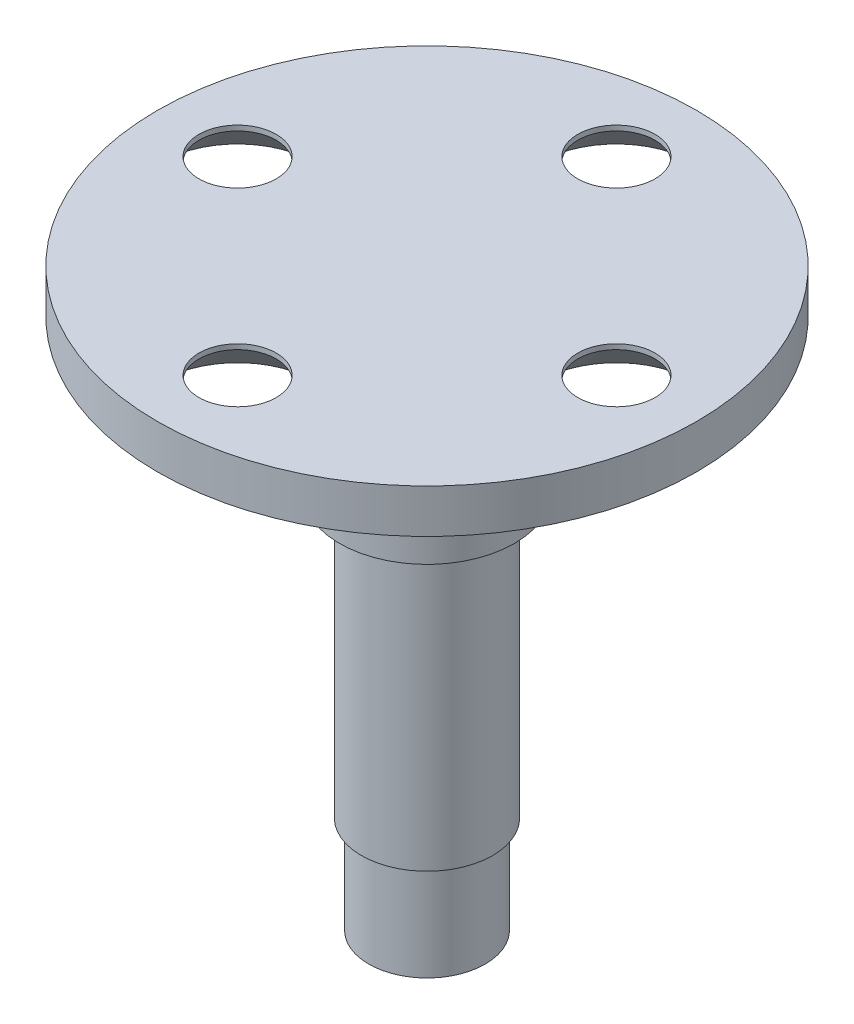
ISO-10303-21;
HEADER;
FILE_DESCRIPTION(('STEP AP214'),'2;1');
FILE_NAME('part.step','',(''),(''),'','','');
FILE_SCHEMA(('AUTOMOTIVE_DESIGN { 1 0 10303 214 1 1 1 1 }'));
ENDSEC;
DATA;
#1=APPLICATION_CONTEXT('core data for automotive mechanical design processes');
#2=APPLICATION_PROTOCOL_DEFINITION('international standard','automotive_design',2000,#1);
#3=PRODUCT_CONTEXT('',#1,'mechanical');
#4=PRODUCT('Part','Part','',(#3));
#5=PRODUCT_RELATED_PRODUCT_CATEGORY('part','',(#4));
#6=PRODUCT_DEFINITION_FORMATION('','',#4);
#7=PRODUCT_DEFINITION_CONTEXT('part definition',#1,'design');
#8=PRODUCT_DEFINITION('design','',#6,#7);
#9=PRODUCT_DEFINITION_SHAPE('','',#8);
#10=(LENGTH_UNIT() NAMED_UNIT(*) SI_UNIT(.MILLI.,.METRE.));
#11=(NAMED_UNIT(*) PLANE_ANGLE_UNIT() SI_UNIT($,.RADIAN.));
#12=(NAMED_UNIT(*) SI_UNIT($,.STERADIAN.) SOLID_ANGLE_UNIT());
#13=UNCERTAINTY_MEASURE_WITH_UNIT(LENGTH_MEASURE(1.E-05),#10,'distance_accuracy_value','');
#14=(GEOMETRIC_REPRESENTATION_CONTEXT(3) GLOBAL_UNCERTAINTY_ASSIGNED_CONTEXT((#13)) GLOBAL_UNIT_ASSIGNED_CONTEXT((#10,
#11,#12)) REPRESENTATION_CONTEXT('',''));
#15=CARTESIAN_POINT('',(0.,0.,0.));
#16=DIRECTION('',(0.,0.,1.));
#17=DIRECTION('',(1.,0.,0.));
#18=AXIS2_PLACEMENT_3D('',#15,#16,#17);
#19=CARTESIAN_POINT('',(0.,-36.,0.));
#20=DIRECTION('',(0.,-1.,0.));
#21=DIRECTION('',(1.,0.,0.));
#22=AXIS2_PLACEMENT_3D('',#19,#20,#21);
#23=CYLINDRICAL_SURFACE('',#22,4.5);
#24=CARTESIAN_POINT('',(0.,-10.,0.));
#25=DIRECTION('',(0.,-1.,0.));
#26=DIRECTION('',(1.,0.,0.));
#27=AXIS2_PLACEMENT_3D('',#24,#25,#26);
#28=CIRCLE('',#27,4.5);
#29=CARTESIAN_POINT('',(4.5,-10.,0.));
#30=VERTEX_POINT('',#29);
#31=EDGE_CURVE('E195',#30,#30,#28,.T.);
#32=ORIENTED_EDGE('',*,*,#31,.T.);
#33=EDGE_LOOP('',(#32));
#34=FACE_BOUND('',#33,.T.);
#35=CARTESIAN_POINT('',(0.,-29.3,0.));
#36=DIRECTION('',(0.,-1.,0.));
#37=DIRECTION('',(1.,0.,0.));
#38=AXIS2_PLACEMENT_3D('',#35,#36,#37);
#39=CIRCLE('',#38,4.5);
#40=CARTESIAN_POINT('',(4.5,-29.3,0.));
#41=VERTEX_POINT('',#40);
#42=EDGE_CURVE('E180',#41,#41,#39,.T.);
#43=ORIENTED_EDGE('',*,*,#42,.F.);
#44=EDGE_LOOP('',(#43));
#45=FACE_BOUND('',#44,.T.);
#46=DIRECTION('',(0.,-1.,0.));
#47=VECTOR('',#46,1.);
#48=CARTESIAN_POINT('',(-4.24264068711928,-36.,-1.5));
#49=LINE('',#48,#47);
#50=CARTESIAN_POINT('',(-4.24264068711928,-22.,-1.5));
#51=VERTEX_POINT('',#50);
#52=CARTESIAN_POINT('',(-4.24264068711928,-12.,-1.5));
#53=VERTEX_POINT('',#52);
#54=EDGE_CURVE('E13',#51,#53,#49,.F.);
#55=ORIENTED_EDGE('',*,*,#54,.T.);
#56=CARTESIAN_POINT('',(-4.24264068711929,-12.,1.5));
#57=CARTESIAN_POINT('',(-4.24264041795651,-12.0817022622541,1.50000038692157));
#58=CARTESIAN_POINT('',(-4.24502653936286,-12.1634021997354,1.49330217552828));
#59=CARTESIAN_POINT('',(-4.25426361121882,-12.3243816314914,1.46677669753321));
#60=CARTESIAN_POINT('',(-4.26111529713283,-12.4036607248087,1.44694726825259));
#61=CARTESIAN_POINT('',(-4.27842305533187,-12.5574403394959,1.39493322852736));
#62=CARTESIAN_POINT('',(-4.28887205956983,-12.6319498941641,1.36277283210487));
#63=CARTESIAN_POINT('',(-4.31218683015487,-12.7745400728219,1.28709244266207));
#64=CARTESIAN_POINT('',(-4.32505312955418,-12.8426192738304,1.24356994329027));
#65=CARTESIAN_POINT('',(-4.3523173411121,-12.9730799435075,1.14457671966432));
#66=CARTESIAN_POINT('',(-4.36675342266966,-13.0351731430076,1.08873651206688));
#67=CARTESIAN_POINT('',(-4.39520797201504,-13.149310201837,0.967481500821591));
#68=CARTESIAN_POINT('',(-4.40922637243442,-13.2013524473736,0.902065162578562));
#69=CARTESIAN_POINT('',(-4.43570800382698,-13.2952183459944,0.761406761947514));
#70=CARTESIAN_POINT('',(-4.44812111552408,-13.3367399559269,0.685952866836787));
#71=CARTESIAN_POINT('',(-4.46954380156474,-13.4063873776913,0.52864683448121));
#72=CARTESIAN_POINT('',(-4.47855429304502,-13.4345167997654,0.446796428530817));
#73=CARTESIAN_POINT('',(-4.49188613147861,-13.4756037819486,0.28204322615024));
#74=CARTESIAN_POINT('',(-4.49635972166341,-13.4890551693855,0.19927613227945));
#75=CARTESIAN_POINT('',(-4.5006541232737,-13.501974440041,0.0325468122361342));
#76=CARTESIAN_POINT('',(-4.50047613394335,-13.5014459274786,-0.0514151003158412));
#77=CARTESIAN_POINT('',(-4.49559059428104,-13.486733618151,-0.214655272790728));
#78=CARTESIAN_POINT('',(-4.49106097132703,-13.4730862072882,-0.293988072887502));
#79=CARTESIAN_POINT('',(-4.47820451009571,-13.4334105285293,-0.449165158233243));
#80=CARTESIAN_POINT('',(-4.46987741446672,-13.4073814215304,-0.525009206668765));
#81=CARTESIAN_POINT('',(-4.45013505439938,-13.3433680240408,-0.672228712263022));
#82=CARTESIAN_POINT('',(-4.43868063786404,-13.3052310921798,-0.743532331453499));
#83=CARTESIAN_POINT('',(-4.41387589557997,-13.2182104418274,-0.878886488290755));
#84=CARTESIAN_POINT('',(-4.40052504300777,-13.16932373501,-0.942935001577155));
#85=CARTESIAN_POINT('',(-4.37259287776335,-13.0594884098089,-1.06515129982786));
#86=CARTESIAN_POINT('',(-4.35798322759,-12.9980802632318,-1.12290023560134));
#87=CARTESIAN_POINT('',(-4.32971002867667,-12.866326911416,-1.22741588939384));
#88=CARTESIAN_POINT('',(-4.31604662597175,-12.7959803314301,-1.27418091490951));
#89=CARTESIAN_POINT('',(-4.29105787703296,-12.6470195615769,-1.3559811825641));
#90=CARTESIAN_POINT('',(-4.27976864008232,-12.5683018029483,-1.39083969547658));
#91=CARTESIAN_POINT('',(-4.26122476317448,-12.4056429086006,-1.44666478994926));
#92=CARTESIAN_POINT('',(-4.25396843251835,-12.3217039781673,-1.4676371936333));
#93=CARTESIAN_POINT('',(-4.24469454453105,-12.1550424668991,-1.49424192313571));
#94=CARTESIAN_POINT('',(-4.24245540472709,-12.0724358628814,-1.50052364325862));
#95=CARTESIAN_POINT('',(-4.242850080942,-11.9073357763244,-1.49940815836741));
#96=CARTESIAN_POINT('',(-4.24548301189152,-11.8248422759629,-1.49201343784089));
#97=CARTESIAN_POINT('',(-4.25510427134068,-11.6652645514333,-1.46433847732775));
#98=CARTESIAN_POINT('',(-4.2619398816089,-11.588091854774,-1.44450959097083));
#99=CARTESIAN_POINT('',(-4.27902830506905,-11.4381845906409,-1.3930707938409));
#100=CARTESIAN_POINT('',(-4.2892817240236,-11.3654508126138,-1.36145879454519));
#101=CARTESIAN_POINT('',(-4.31245316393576,-11.2239293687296,-1.28621151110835));
#102=CARTESIAN_POINT('',(-4.32544538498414,-11.1553400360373,-1.24222667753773));
#103=CARTESIAN_POINT('',(-4.35248653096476,-11.0262809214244,-1.14387844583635));
#104=CARTESIAN_POINT('',(-4.36653576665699,-10.9658135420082,-1.08951198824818));
#105=CARTESIAN_POINT('',(-4.39492557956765,-10.8517080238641,-0.968837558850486));
#106=CARTESIAN_POINT('',(-4.40924765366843,-10.7985384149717,-0.902080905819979));
#107=CARTESIAN_POINT('',(-4.43590277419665,-10.7041257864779,-0.760240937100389));
#108=CARTESIAN_POINT('',(-4.44823589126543,-10.6628823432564,-0.685157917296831));
#109=CARTESIAN_POINT('',(-4.46946608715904,-10.5938698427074,-0.529169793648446));
#110=CARTESIAN_POINT('',(-4.47838545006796,-10.5660130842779,-0.448306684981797));
#111=CARTESIAN_POINT('',(-4.49187916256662,-10.5244083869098,-0.282687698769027));
#112=CARTESIAN_POINT('',(-4.49645508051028,-10.5106553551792,-0.197933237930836));
#113=CARTESIAN_POINT('',(-4.50062794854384,-10.4981068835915,-0.0312230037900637));
#114=CARTESIAN_POINT('',(-4.50044880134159,-10.4986388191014,0.0506770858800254));
#115=CARTESIAN_POINT('',(-4.49568294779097,-10.5129859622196,0.213166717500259));
#116=CARTESIAN_POINT('',(-4.49109659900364,-10.5268000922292,0.293756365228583));
#117=CARTESIAN_POINT('',(-4.47811372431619,-10.5668733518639,0.450063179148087));
#118=CARTESIAN_POINT('',(-4.46977887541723,-10.5929313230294,0.525837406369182));
#119=CARTESIAN_POINT('',(-4.45015741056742,-10.6565662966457,0.671967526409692));
#120=CARTESIAN_POINT('',(-4.43887026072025,-10.6941453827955,0.742322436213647));
#121=CARTESIAN_POINT('',(-4.41398803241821,-10.781354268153,0.878451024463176));
#122=CARTESIAN_POINT('',(-4.4003230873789,-10.8313780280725,0.94395937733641));
#123=CARTESIAN_POINT('',(-4.37239483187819,-10.9413860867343,1.06587153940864));
#124=CARTESIAN_POINT('',(-4.35813133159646,-11.0013735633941,1.12227243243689));
#125=CARTESIAN_POINT('',(-4.32994919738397,-11.1324140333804,1.22661271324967));
#126=CARTESIAN_POINT('',(-4.31606591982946,-11.203808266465,1.27413444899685));
#127=CARTESIAN_POINT('',(-4.29090289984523,-11.3540016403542,1.35647151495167));
#128=CARTESIAN_POINT('',(-4.27962247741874,-11.4327988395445,1.39129016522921));
#129=CARTESIAN_POINT('',(-4.26152001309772,-11.5919427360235,1.44576574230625));
#130=CARTESIAN_POINT('',(-4.25451949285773,-11.6720583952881,1.46603686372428));
#131=CARTESIAN_POINT('',(-4.24508075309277,-11.8347840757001,1.4931514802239));
#132=CARTESIAN_POINT('',(-4.24264095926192,-11.9173932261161,1.49999960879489));
#133=CARTESIAN_POINT('',(-4.24264068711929,-12.,1.5));
#134=B_SPLINE_CURVE_WITH_KNOTS('',3,(#56,#57,#58,#59,#60,#61,#62,#63,#64,#65,#66,#67,#68,#69,
#70,#71,#72,#73,#74,#75,#76,#77,#78,#79,#80,#81,#82,#83,#84,#85,#86,#87,#88,#89,#90,#91,#92,#93,
#94,#95,#96,#97,#98,#99,#100,#101,#102,#103,#104,#105,#106,#107,#108,#109,#110,#111,#112,#113,
#114,#115,#116,#117,#118,#119,#120,#121,#122,#123,#124,#125,#126,#127,#128,#129,#130,#131,#132,
#133),.UNSPECIFIED.,.T.,.F.,(4,2,2,2,2,2,2,2,2,2,2,2,2,2,2,2,2,2,2,2,2,2,2,2,2,2,2,2,2,2,2,2,2,
2,2,2,2,2,4),(0.,0.244800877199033,0.489642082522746,0.734004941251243,0.978421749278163,
1.23152006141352,1.48465897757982,1.74440259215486,2.00407614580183,2.25471478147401,
2.50528879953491,2.74603507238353,2.98679766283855,3.23072482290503,3.47471987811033,
3.73020261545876,3.98572469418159,4.24488959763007,4.50394577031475,4.75131437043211,
4.99863803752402,5.23746593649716,5.47633618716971,5.72278286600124,5.96930228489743,
6.22768212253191,6.4860527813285,6.74270686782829,6.99926824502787,7.24377127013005,
7.48825446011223,7.72885434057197,7.96949776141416,8.21903279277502,8.46864756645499,
8.72803354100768,8.98735167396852,9.23494818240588,9.48245920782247),.UNSPECIFIED.);
#135=CARTESIAN_POINT('',(-4.24264068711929,-12.,1.5));
#136=VERTEX_POINT('',#135);
#137=EDGE_CURVE('E198',#53,#136,#134,.T.);
#138=ORIENTED_EDGE('',*,*,#137,.T.);
#139=DIRECTION('',(0.,-1.,0.));
#140=VECTOR('',#139,1.);
#141=CARTESIAN_POINT('',(-4.24264068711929,-36.,1.5));
#142=LINE('',#141,#140);
#143=CARTESIAN_POINT('',(-4.24264068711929,-22.,1.5));
#144=VERTEX_POINT('',#143);
#145=EDGE_CURVE('E66',#136,#144,#142,.T.);
#146=ORIENTED_EDGE('',*,*,#145,.T.);
#147=CARTESIAN_POINT('',(-4.24264068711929,-22.,1.5));
#148=CARTESIAN_POINT('',(-4.24264041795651,-22.0817022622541,1.50000038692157));
#149=CARTESIAN_POINT('',(-4.24502653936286,-22.1634021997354,1.49330217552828));
#150=CARTESIAN_POINT('',(-4.25426361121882,-22.3243816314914,1.46677669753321));
#151=CARTESIAN_POINT('',(-4.26111529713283,-22.4036607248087,1.44694726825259));
#152=CARTESIAN_POINT('',(-4.27842305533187,-22.5574403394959,1.39493322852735));
#153=CARTESIAN_POINT('',(-4.28887205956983,-22.6319498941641,1.36277283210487));
#154=CARTESIAN_POINT('',(-4.31218683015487,-22.7745400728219,1.28709244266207));
#155=CARTESIAN_POINT('',(-4.32505312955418,-22.8426192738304,1.24356994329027));
#156=CARTESIAN_POINT('',(-4.3523173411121,-22.9730799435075,1.14457671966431));
#157=CARTESIAN_POINT('',(-4.36675342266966,-23.0351731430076,1.08873651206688));
#158=CARTESIAN_POINT('',(-4.39520797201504,-23.149310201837,0.96748150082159));
#159=CARTESIAN_POINT('',(-4.40922637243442,-23.2013524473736,0.902065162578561));
#160=CARTESIAN_POINT('',(-4.43570800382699,-23.2952183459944,0.761406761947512));
#161=CARTESIAN_POINT('',(-4.44812111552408,-23.3367399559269,0.685952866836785));
#162=CARTESIAN_POINT('',(-4.46954380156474,-23.4063873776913,0.528646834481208));
#163=CARTESIAN_POINT('',(-4.47855429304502,-23.4345167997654,0.446796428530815));
#164=CARTESIAN_POINT('',(-4.4918861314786,-23.4756037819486,0.282043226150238));
#165=CARTESIAN_POINT('',(-4.49635972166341,-23.4890551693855,0.199276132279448));
#166=CARTESIAN_POINT('',(-4.5006541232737,-23.501974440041,0.0325468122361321));
#167=CARTESIAN_POINT('',(-4.50047613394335,-23.5014459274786,-0.0514151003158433));
#168=CARTESIAN_POINT('',(-4.49559059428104,-23.486733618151,-0.21465527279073));
#169=CARTESIAN_POINT('',(-4.49106097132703,-23.4730862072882,-0.293988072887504));
#170=CARTESIAN_POINT('',(-4.47820451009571,-23.4334105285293,-0.449165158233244));
#171=CARTESIAN_POINT('',(-4.46987741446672,-23.4073814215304,-0.525009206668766));
#172=CARTESIAN_POINT('',(-4.45013505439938,-23.3433680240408,-0.672228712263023));
#173=CARTESIAN_POINT('',(-4.43868063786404,-23.3052310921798,-0.7435323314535));
#174=CARTESIAN_POINT('',(-4.41387589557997,-23.2182104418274,-0.878886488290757));
#175=CARTESIAN_POINT('',(-4.40052504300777,-23.16932373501,-0.942935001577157));
#176=CARTESIAN_POINT('',(-4.37259287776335,-23.0594884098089,-1.06515129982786));
#177=CARTESIAN_POINT('',(-4.35798322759,-22.9980802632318,-1.12290023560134));
#178=CARTESIAN_POINT('',(-4.32971002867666,-22.866326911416,-1.22741588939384));
#179=CARTESIAN_POINT('',(-4.31604662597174,-22.7959803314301,-1.27418091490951));
#180=CARTESIAN_POINT('',(-4.29105787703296,-22.6470195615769,-1.3559811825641));
#181=CARTESIAN_POINT('',(-4.27976864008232,-22.5683018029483,-1.39083969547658));
#182=CARTESIAN_POINT('',(-4.26122476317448,-22.4056429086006,-1.44666478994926));
#183=CARTESIAN_POINT('',(-4.25396843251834,-22.3217039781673,-1.4676371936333));
#184=CARTESIAN_POINT('',(-4.24469454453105,-22.1550424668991,-1.49424192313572));
#185=CARTESIAN_POINT('',(-4.24245540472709,-22.0724358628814,-1.50052364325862));
#186=CARTESIAN_POINT('',(-4.242850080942,-21.9073357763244,-1.49940815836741));
#187=CARTESIAN_POINT('',(-4.24548301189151,-21.8248422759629,-1.49201343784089));
#188=CARTESIAN_POINT('',(-4.25510427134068,-21.6652645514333,-1.46433847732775));
#189=CARTESIAN_POINT('',(-4.2619398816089,-21.588091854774,-1.44450959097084));
#190=CARTESIAN_POINT('',(-4.27902830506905,-21.4381845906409,-1.3930707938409));
#191=CARTESIAN_POINT('',(-4.2892817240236,-21.3654508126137,-1.36145879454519));
#192=CARTESIAN_POINT('',(-4.31245316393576,-21.2239293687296,-1.28621151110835));
#193=CARTESIAN_POINT('',(-4.32544538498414,-21.1553400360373,-1.24222667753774));
#194=CARTESIAN_POINT('',(-4.35248653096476,-21.0262809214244,-1.14387844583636));
#195=CARTESIAN_POINT('',(-4.36653576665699,-20.9658135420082,-1.08951198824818));
#196=CARTESIAN_POINT('',(-4.39492557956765,-20.8517080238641,-0.968837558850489));
#197=CARTESIAN_POINT('',(-4.40924765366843,-20.7985384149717,-0.902080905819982));
#198=CARTESIAN_POINT('',(-4.43590277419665,-20.7041257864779,-0.760240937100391));
#199=CARTESIAN_POINT('',(-4.44823589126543,-20.6628823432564,-0.685157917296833));
#200=CARTESIAN_POINT('',(-4.46946608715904,-20.5938698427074,-0.529169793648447));
#201=CARTESIAN_POINT('',(-4.47838545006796,-20.5660130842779,-0.448306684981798));
#202=CARTESIAN_POINT('',(-4.49187916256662,-20.5244083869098,-0.282687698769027));
#203=CARTESIAN_POINT('',(-4.49645508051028,-20.5106553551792,-0.197933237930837));
#204=CARTESIAN_POINT('',(-4.50062794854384,-20.4981068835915,-0.0312230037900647));
#205=CARTESIAN_POINT('',(-4.50044880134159,-20.4986388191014,0.0506770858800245));
#206=CARTESIAN_POINT('',(-4.49568294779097,-20.5129859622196,0.213166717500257));
#207=CARTESIAN_POINT('',(-4.49109659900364,-20.5268000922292,0.293756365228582));
#208=CARTESIAN_POINT('',(-4.47811372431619,-20.5668733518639,0.450063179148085));
#209=CARTESIAN_POINT('',(-4.46977887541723,-20.5929313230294,0.52583740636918));
#210=CARTESIAN_POINT('',(-4.45015741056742,-20.6565662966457,0.67196752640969));
#211=CARTESIAN_POINT('',(-4.43887026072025,-20.6941453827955,0.742322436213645));
#212=CARTESIAN_POINT('',(-4.41398803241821,-20.781354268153,0.878451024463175));
#213=CARTESIAN_POINT('',(-4.4003230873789,-20.8313780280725,0.943959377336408));
#214=CARTESIAN_POINT('',(-4.37239483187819,-20.9413860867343,1.06587153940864));
#215=CARTESIAN_POINT('',(-4.35813133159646,-21.0013735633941,1.12227243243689));
#216=CARTESIAN_POINT('',(-4.32994919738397,-21.1324140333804,1.22661271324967));
#217=CARTESIAN_POINT('',(-4.31606591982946,-21.203808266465,1.27413444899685));
#218=CARTESIAN_POINT('',(-4.29090289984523,-21.3540016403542,1.35647151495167));
#219=CARTESIAN_POINT('',(-4.27962247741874,-21.4327988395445,1.39129016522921));
#220=CARTESIAN_POINT('',(-4.26152001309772,-21.5919427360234,1.44576574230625));
#221=CARTESIAN_POINT('',(-4.25451949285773,-21.6720583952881,1.46603686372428));
#222=CARTESIAN_POINT('',(-4.24508075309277,-21.8347840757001,1.4931514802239));
#223=CARTESIAN_POINT('',(-4.24264095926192,-21.9173932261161,1.49999960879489));
#224=CARTESIAN_POINT('',(-4.24264068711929,-22.,1.5));
#225=B_SPLINE_CURVE_WITH_KNOTS('',3,(#147,#148,#149,#150,#151,#152,#153,#154,#155,#156,#157,
#158,#159,#160,#161,#162,#163,#164,#165,#166,#167,#168,#169,#170,#171,#172,#173,#174,#175,#176,
#177,#178,#179,#180,#181,#182,#183,#184,#185,#186,#187,#188,#189,#190,#191,#192,#193,#194,#195,
#196,#197,#198,#199,#200,#201,#202,#203,#204,#205,#206,#207,#208,#209,#210,#211,#212,#213,#214,
#215,#216,#217,#218,#219,#220,#221,#222,#223,#224),.UNSPECIFIED.,.T.,.F.,(4,2,2,2,2,2,2,2,2,2,2,
2,2,2,2,2,2,2,2,2,2,2,2,2,2,2,2,2,2,2,2,2,2,2,2,2,2,2,4),(0.,0.244800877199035,
0.489642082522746,0.73400494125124,0.978421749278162,1.23152006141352,1.48465897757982,
1.74440259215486,2.00407614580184,2.25471478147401,2.50528879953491,2.74603507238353,
2.98679766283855,3.23072482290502,3.47471987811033,3.73020261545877,3.98572469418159,
4.24488959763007,4.50394577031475,4.75131437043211,4.99863803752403,5.23746593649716,
5.47633618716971,5.72278286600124,5.96930228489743,6.22768212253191,6.48605278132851,
6.74270686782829,6.99926824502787,7.24377127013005,7.48825446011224,7.72885434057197,
7.96949776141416,8.21903279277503,8.468647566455,8.72803354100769,8.98735167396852,
9.23494818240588,9.48245920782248),.UNSPECIFIED.);
#226=EDGE_CURVE('E73',#144,#51,#225,.T.);
#227=ORIENTED_EDGE('',*,*,#226,.T.);
#228=EDGE_LOOP('',(#55,#138,#146,#227));
#229=FACE_BOUND('',#228,.T.);
#230=ADVANCED_FACE('F58',(#34,#45,#229),#23,.T.);
#231=CARTESIAN_POINT('',(6.,0.,0.));
#232=DIRECTION('',(0.,-1.,0.));
#233=DIRECTION('',(1.,0.,0.));
#234=AXIS2_PLACEMENT_3D('',#231,#232,#233);
#235=PLANE('',#234);
#236=CARTESIAN_POINT('',(0.,0.,0.));
#237=DIRECTION('',(0.,-1.,0.));
#238=DIRECTION('',(1.,0.,0.));
#239=AXIS2_PLACEMENT_3D('',#236,#237,#238);
#240=CIRCLE('',#239,6.);
#241=CARTESIAN_POINT('',(6.,0.,0.));
#242=VERTEX_POINT('',#241);
#243=EDGE_CURVE('E189',#242,#242,#240,.T.);
#244=ORIENTED_EDGE('',*,*,#243,.F.);
#245=EDGE_LOOP('',(#244));
#246=FACE_BOUND('',#245,.T.);
#247=CARTESIAN_POINT('',(0.,0.,0.));
#248=DIRECTION('',(0.,-1.,0.));
#249=DIRECTION('',(0.,0.,-1.));
#250=AXIS2_PLACEMENT_3D('',#247,#248,#249);
#251=CIRCLE('',#250,7.5);
#252=CARTESIAN_POINT('',(0.,0.,-7.5));
#253=VERTEX_POINT('',#252);
#254=EDGE_CURVE('E165',#253,#253,#251,.T.);
#255=ORIENTED_EDGE('',*,*,#254,.T.);
#256=EDGE_LOOP('',(#255));
#257=FACE_BOUND('',#256,.T.);
#258=ADVANCED_FACE('F293',(#246,#257),#235,.T.);
#259=CARTESIAN_POINT('',(6.,-10.,0.));
#260=DIRECTION('',(0.,-1.,0.));
#261=DIRECTION('',(1.,0.,0.));
#262=AXIS2_PLACEMENT_3D('',#259,#260,#261);
#263=PLANE('',#262);
#264=CARTESIAN_POINT('',(0.,-10.,0.));
#265=DIRECTION('',(0.,-1.,0.));
#266=DIRECTION('',(1.,0.,0.));
#267=AXIS2_PLACEMENT_3D('',#264,#265,#266);
#268=CIRCLE('',#267,6.);
#269=CARTESIAN_POINT('',(6.,-10.,0.));
#270=VERTEX_POINT('',#269);
#271=EDGE_CURVE('E192',#270,#270,#268,.T.);
#272=ORIENTED_EDGE('',*,*,#271,.T.);
#273=EDGE_LOOP('',(#272));
#274=FACE_BOUND('',#273,.T.);
#275=ORIENTED_EDGE('',*,*,#31,.F.);
#276=EDGE_LOOP('',(#275));
#277=FACE_BOUND('',#276,.T.);
#278=ADVANCED_FACE('F296',(#274,#277),#263,.T.);
#279=CARTESIAN_POINT('',(0.,-36.,0.));
#280=DIRECTION('',(0.,-1.,0.));
#281=DIRECTION('',(1.,0.,0.));
#282=AXIS2_PLACEMENT_3D('',#279,#280,#281);
#283=CYLINDRICAL_SURFACE('',#282,6.);
#284=ORIENTED_EDGE('',*,*,#243,.T.);
#285=EDGE_LOOP('',(#284));
#286=FACE_BOUND('',#285,.T.);
#287=ORIENTED_EDGE('',*,*,#271,.F.);
#288=EDGE_LOOP('',(#287));
#289=FACE_BOUND('',#288,.T.);
#290=ADVANCED_FACE('F291',(#286,#289),#283,.T.);
#291=CARTESIAN_POINT('',(4.,-36.,0.));
#292=DIRECTION('',(0.,-1.,0.));
#293=DIRECTION('',(1.,0.,0.));
#294=AXIS2_PLACEMENT_3D('',#291,#292,#293);
#295=PLANE('',#294);
#296=CARTESIAN_POINT('',(0.,-36.,0.));
#297=DIRECTION('',(0.,-1.,0.));
#298=DIRECTION('',(0.,0.,-1.));
#299=AXIS2_PLACEMENT_3D('',#296,#297,#298);
#300=CIRCLE('',#299,2.5);
#301=CARTESIAN_POINT('',(0.,-36.,-2.5));
#302=VERTEX_POINT('',#301);
#303=EDGE_CURVE('E177',#302,#302,#300,.T.);
#304=ORIENTED_EDGE('',*,*,#303,.F.);
#305=EDGE_LOOP('',(#304));
#306=FACE_BOUND('',#305,.T.);
#307=CARTESIAN_POINT('',(0.,-36.,0.));
#308=DIRECTION('',(0.,-1.,0.));
#309=DIRECTION('',(1.,0.,0.));
#310=AXIS2_PLACEMENT_3D('',#307,#308,#309);
#311=CIRCLE('',#310,4.);
#312=CARTESIAN_POINT('',(4.,-36.,0.));
#313=VERTEX_POINT('',#312);
#314=EDGE_CURVE('E186',#313,#313,#311,.T.);
#315=ORIENTED_EDGE('',*,*,#314,.T.);
#316=EDGE_LOOP('',(#315));
#317=FACE_BOUND('',#316,.T.);
#318=ADVANCED_FACE('F287',(#306,#317),#295,.T.);
#319=CARTESIAN_POINT('',(0.,-36.,0.));
#320=DIRECTION('',(0.,-1.,0.));
#321=DIRECTION('',(1.,0.,0.));
#322=AXIS2_PLACEMENT_3D('',#319,#320,#321);
#323=CYLINDRICAL_SURFACE('',#322,4.);
#324=CARTESIAN_POINT('',(0.,-29.3,0.));
#325=DIRECTION('',(0.,-1.,0.));
#326=DIRECTION('',(1.,0.,0.));
#327=AXIS2_PLACEMENT_3D('',#324,#325,#326);
#328=CIRCLE('',#327,4.);
#329=CARTESIAN_POINT('',(4.,-29.3,0.));
#330=VERTEX_POINT('',#329);
#331=EDGE_CURVE('E183',#330,#330,#328,.T.);
#332=ORIENTED_EDGE('',*,*,#331,.T.);
#333=EDGE_LOOP('',(#332));
#334=FACE_BOUND('',#333,.T.);
#335=ORIENTED_EDGE('',*,*,#314,.F.);
#336=EDGE_LOOP('',(#335));
#337=FACE_BOUND('',#336,.T.);
#338=ADVANCED_FACE('F283',(#334,#337),#323,.T.);
#339=CARTESIAN_POINT('',(4.5,-29.3,0.));
#340=DIRECTION('',(0.,-1.,0.));
#341=DIRECTION('',(1.,0.,0.));
#342=AXIS2_PLACEMENT_3D('',#339,#340,#341);
#343=PLANE('',#342);
#344=ORIENTED_EDGE('',*,*,#42,.T.);
#345=EDGE_LOOP('',(#344));
#346=FACE_BOUND('',#345,.T.);
#347=ORIENTED_EDGE('',*,*,#331,.F.);
#348=EDGE_LOOP('',(#347));
#349=FACE_BOUND('',#348,.T.);
#350=ADVANCED_FACE('F279',(#346,#349),#343,.T.);
#351=CARTESIAN_POINT('',(0.,-36.,0.));
#352=DIRECTION('',(0.,-1.,0.));
#353=DIRECTION('',(0.,0.,-1.));
#354=AXIS2_PLACEMENT_3D('',#351,#352,#353);
#355=CONICAL_SURFACE('',#354,2.5,0.785398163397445);
#356=CARTESIAN_POINT('',(0.,-35.6,0.));
#357=DIRECTION('',(0.,-1.,0.));
#358=DIRECTION('',(0.,0.,-1.));
#359=AXIS2_PLACEMENT_3D('',#356,#357,#358);
#360=CIRCLE('',#359,2.1);
#361=CARTESIAN_POINT('',(0.,-35.6,-2.1));
#362=VERTEX_POINT('',#361);
#363=EDGE_CURVE('E174',#362,#362,#360,.T.);
#364=ORIENTED_EDGE('',*,*,#363,.F.);
#365=EDGE_LOOP('',(#364));
#366=FACE_BOUND('',#365,.T.);
#367=ORIENTED_EDGE('',*,*,#303,.T.);
#368=EDGE_LOOP('',(#367));
#369=FACE_BOUND('',#368,.T.);
#370=ADVANCED_FACE('F275',(#366,#369),#355,.F.);
#371=CARTESIAN_POINT('',(0.,-36.,0.));
#372=DIRECTION('',(0.,-1.,0.));
#373=DIRECTION('',(0.,0.,-1.));
#374=AXIS2_PLACEMENT_3D('',#371,#372,#373);
#375=CYLINDRICAL_SURFACE('',#374,2.1);
#376=CARTESIAN_POINT('',(0.,-28.,0.));
#377=DIRECTION('',(0.,-1.,0.));
#378=DIRECTION('',(0.,0.,-1.));
#379=AXIS2_PLACEMENT_3D('',#376,#377,#378);
#380=CIRCLE('',#379,2.1);
#381=CARTESIAN_POINT('',(0.,-28.,-2.1));
#382=VERTEX_POINT('',#381);
#383=EDGE_CURVE('E171',#382,#382,#380,.T.);
#384=ORIENTED_EDGE('',*,*,#383,.F.);
#385=EDGE_LOOP('',(#384));
#386=FACE_BOUND('',#385,.T.);
#387=ORIENTED_EDGE('',*,*,#363,.T.);
#388=EDGE_LOOP('',(#387));
#389=FACE_BOUND('',#388,.T.);
#390=ADVANCED_FACE('F272',(#386,#389),#375,.F.);
#391=CARTESIAN_POINT('',(0.,-28.,0.));
#392=DIRECTION('',(0.,-1.,0.));
#393=DIRECTION('',(0.,0.,-1.));
#394=AXIS2_PLACEMENT_3D('',#391,#392,#393);
#395=CONICAL_SURFACE('',#394,2.1,1.0471975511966);
#396=CARTESIAN_POINT('',(0.,-26.7875644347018,0.));
#397=VERTEX_POINT('',#396);
#398=VERTEX_LOOP('',#397);
#399=FACE_BOUND('',#398,.T.);
#400=ORIENTED_EDGE('',*,*,#383,.T.);
#401=EDGE_LOOP('',(#400));
#402=FACE_BOUND('',#401,.T.);
#403=ADVANCED_FACE('F268',(#399,#402),#395,.F.);
#404=CARTESIAN_POINT('',(0.,0.5,0.));
#405=DIRECTION('',(0.,-1.,0.));
#406=DIRECTION('',(0.,0.,-1.));
#407=AXIS2_PLACEMENT_3D('',#404,#405,#406);
#408=PLANE('',#407);
#409=CARTESIAN_POINT('',(0.,0.5,13.));
#410=DIRECTION('',(0.,-1.,0.));
#411=DIRECTION('',(0.,0.,-1.));
#412=AXIS2_PLACEMENT_3D('',#409,#410,#411);
#413=CIRCLE('',#412,5.3);
#414=CARTESIAN_POINT('',(0.,0.5,7.7));
#415=VERTEX_POINT('',#414);
#416=EDGE_CURVE('E129',#415,#415,#413,.T.);
#417=ORIENTED_EDGE('',*,*,#416,.F.);
#418=EDGE_LOOP('',(#417));
#419=FACE_BOUND('',#418,.T.);
#420=CARTESIAN_POINT('',(13.,0.5,0.));
#421=DIRECTION('',(0.,-1.,0.));
#422=DIRECTION('',(0.,0.,-1.));
#423=AXIS2_PLACEMENT_3D('',#420,#421,#422);
#424=CIRCLE('',#423,5.3);
#425=CARTESIAN_POINT('',(13.,0.5,-5.3));
#426=VERTEX_POINT('',#425);
#427=EDGE_CURVE('E138',#426,#426,#424,.T.);
#428=ORIENTED_EDGE('',*,*,#427,.F.);
#429=EDGE_LOOP('',(#428));
#430=FACE_BOUND('',#429,.T.);
#431=CARTESIAN_POINT('',(0.,0.5,-13.));
#432=DIRECTION('',(0.,-1.,0.));
#433=DIRECTION('',(0.,0.,-1.));
#434=AXIS2_PLACEMENT_3D('',#431,#432,#433);
#435=CIRCLE('',#434,5.3);
#436=CARTESIAN_POINT('',(0.,0.5,-18.3));
#437=VERTEX_POINT('',#436);
#438=EDGE_CURVE('E147',#437,#437,#435,.T.);
#439=ORIENTED_EDGE('',*,*,#438,.F.);
#440=EDGE_LOOP('',(#439));
#441=FACE_BOUND('',#440,.T.);
#442=CARTESIAN_POINT('',(-13.,0.5,0.));
#443=DIRECTION('',(0.,-1.,0.));
#444=DIRECTION('',(0.,0.,-1.));
#445=AXIS2_PLACEMENT_3D('',#442,#443,#444);
#446=CIRCLE('',#445,5.3);
#447=CARTESIAN_POINT('',(-13.,0.5,-5.3));
#448=VERTEX_POINT('',#447);
#449=EDGE_CURVE('E156',#448,#448,#446,.T.);
#450=ORIENTED_EDGE('',*,*,#449,.F.);
#451=EDGE_LOOP('',(#450));
#452=FACE_BOUND('',#451,.T.);
#453=CARTESIAN_POINT('',(0.,0.49999999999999,0.));
#454=DIRECTION('',(0.,-1.,0.));
#455=DIRECTION('',(1.,0.,0.));
#456=AXIS2_PLACEMENT_3D('',#453,#454,#455);
#457=CIRCLE('',#456,18.5);
#458=CARTESIAN_POINT('',(18.5,0.500000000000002,0.));
#459=VERTEX_POINT('',#458);
#460=EDGE_CURVE('E159',#459,#459,#457,.T.);
#461=ORIENTED_EDGE('',*,*,#460,.T.);
#462=EDGE_LOOP('',(#461));
#463=FACE_BOUND('',#462,.T.);
#464=CARTESIAN_POINT('',(0.,0.5,0.));
#465=DIRECTION('',(0.,-1.,0.));
#466=DIRECTION('',(0.,0.,-1.));
#467=AXIS2_PLACEMENT_3D('',#464,#465,#466);
#468=CIRCLE('',#467,7.5);
#469=CARTESIAN_POINT('',(0.,0.5,-7.5));
#470=VERTEX_POINT('',#469);
#471=EDGE_CURVE('E168',#470,#470,#468,.T.);
#472=ORIENTED_EDGE('',*,*,#471,.F.);
#473=EDGE_LOOP('',(#472));
#474=FACE_BOUND('',#473,.T.);
#475=ADVANCED_FACE('F264',(#419,#430,#441,#452,#463,#474),#408,.T.);
#476=CARTESIAN_POINT('',(0.,0.5,0.));
#477=DIRECTION('',(0.,-1.,0.));
#478=DIRECTION('',(0.,0.,-1.));
#479=AXIS2_PLACEMENT_3D('',#476,#477,#478);
#480=CYLINDRICAL_SURFACE('',#479,7.5);
#481=ORIENTED_EDGE('',*,*,#471,.T.);
#482=EDGE_LOOP('',(#481));
#483=FACE_BOUND('',#482,.T.);
#484=ORIENTED_EDGE('',*,*,#254,.F.);
#485=EDGE_LOOP('',(#484));
#486=FACE_BOUND('',#485,.T.);
#487=ADVANCED_FACE('F260',(#483,#486),#480,.T.);
#488=CARTESIAN_POINT('',(18.5,3.5,0.));
#489=DIRECTION('',(0.,-1.,0.));
#490=DIRECTION('',(1.,0.,0.));
#491=AXIS2_PLACEMENT_3D('',#488,#489,#490);
#492=PLANE('',#491);
#493=CARTESIAN_POINT('',(0.,3.5,13.));
#494=DIRECTION('',(0.,-1.,0.));
#495=DIRECTION('',(0.,0.,-1.));
#496=AXIS2_PLACEMENT_3D('',#493,#494,#495);
#497=CIRCLE('',#496,2.65);
#498=CARTESIAN_POINT('',(0.,3.5,10.35));
#499=VERTEX_POINT('',#498);
#500=EDGE_CURVE('E117',#499,#499,#497,.T.);
#501=ORIENTED_EDGE('',*,*,#500,.T.);
#502=EDGE_LOOP('',(#501));
#503=FACE_BOUND('',#502,.T.);
#504=CARTESIAN_POINT('',(13.,3.5,0.));
#505=DIRECTION('',(0.,-1.,0.));
#506=DIRECTION('',(0.,0.,-1.));
#507=AXIS2_PLACEMENT_3D('',#504,#505,#506);
#508=CIRCLE('',#507,2.65);
#509=CARTESIAN_POINT('',(13.,3.5,-2.65));
#510=VERTEX_POINT('',#509);
#511=EDGE_CURVE('E132',#510,#510,#508,.T.);
#512=ORIENTED_EDGE('',*,*,#511,.T.);
#513=EDGE_LOOP('',(#512));
#514=FACE_BOUND('',#513,.T.);
#515=CARTESIAN_POINT('',(0.,3.5,-13.));
#516=DIRECTION('',(0.,-1.,0.));
#517=DIRECTION('',(0.,0.,-1.));
#518=AXIS2_PLACEMENT_3D('',#515,#516,#517);
#519=CIRCLE('',#518,2.65);
#520=CARTESIAN_POINT('',(0.,3.5,-15.65));
#521=VERTEX_POINT('',#520);
#522=EDGE_CURVE('E141',#521,#521,#519,.T.);
#523=ORIENTED_EDGE('',*,*,#522,.T.);
#524=EDGE_LOOP('',(#523));
#525=FACE_BOUND('',#524,.T.);
#526=CARTESIAN_POINT('',(-13.,3.5,0.));
#527=DIRECTION('',(0.,-1.,0.));
#528=DIRECTION('',(0.,0.,-1.));
#529=AXIS2_PLACEMENT_3D('',#526,#527,#528);
#530=CIRCLE('',#529,2.65);
#531=CARTESIAN_POINT('',(-13.,3.5,-2.65));
#532=VERTEX_POINT('',#531);
#533=EDGE_CURVE('E150',#532,#532,#530,.T.);
#534=ORIENTED_EDGE('',*,*,#533,.T.);
#535=EDGE_LOOP('',(#534));
#536=FACE_BOUND('',#535,.T.);
#537=CARTESIAN_POINT('',(0.,3.49999999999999,0.));
#538=DIRECTION('',(0.,-1.,0.));
#539=DIRECTION('',(1.,0.,0.));
#540=AXIS2_PLACEMENT_3D('',#537,#538,#539);
#541=CIRCLE('',#540,18.5);
#542=CARTESIAN_POINT('',(18.5,3.5,0.));
#543=VERTEX_POINT('',#542);
#544=EDGE_CURVE('E162',#543,#543,#541,.T.);
#545=ORIENTED_EDGE('',*,*,#544,.F.);
#546=EDGE_LOOP('',(#545));
#547=FACE_BOUND('',#546,.T.);
#548=ADVANCED_FACE('F256',(#503,#514,#525,#536,#547),#492,.F.);
#549=CARTESIAN_POINT('',(0.,18.4358757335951,0.));
#550=DIRECTION('',(0.,-1.,0.));
#551=DIRECTION('',(1.,0.,0.));
#552=AXIS2_PLACEMENT_3D('',#549,#550,#551);
#553=CYLINDRICAL_SURFACE('',#552,18.5);
#554=ORIENTED_EDGE('',*,*,#460,.F.);
#555=EDGE_LOOP('',(#554));
#556=FACE_BOUND('',#555,.T.);
#557=ORIENTED_EDGE('',*,*,#544,.T.);
#558=EDGE_LOOP('',(#557));
#559=FACE_BOUND('',#558,.T.);
#560=ADVANCED_FACE('F252',(#556,#559),#553,.T.);
#561=CARTESIAN_POINT('',(-13.,0.5,0.));
#562=DIRECTION('',(0.,-1.,0.));
#563=DIRECTION('',(0.,0.,-1.));
#564=AXIS2_PLACEMENT_3D('',#561,#562,#563);
#565=CONICAL_SURFACE('',#564,5.3,0.785398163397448);
#566=CARTESIAN_POINT('',(-13.,3.15,0.));
#567=DIRECTION('',(0.,-1.,0.));
#568=DIRECTION('',(0.,0.,-1.));
#569=AXIS2_PLACEMENT_3D('',#566,#567,#568);
#570=CIRCLE('',#569,2.65);
#571=CARTESIAN_POINT('',(-13.,3.15,-2.65));
#572=VERTEX_POINT('',#571);
#573=EDGE_CURVE('E153',#572,#572,#570,.T.);
#574=ORIENTED_EDGE('',*,*,#573,.F.);
#575=EDGE_LOOP('',(#574));
#576=FACE_BOUND('',#575,.T.);
#577=ORIENTED_EDGE('',*,*,#449,.T.);
#578=EDGE_LOOP('',(#577));
#579=FACE_BOUND('',#578,.T.);
#580=ADVANCED_FACE('F248',(#576,#579),#565,.F.);
#581=CARTESIAN_POINT('',(-13.,0.5,0.));
#582=DIRECTION('',(0.,-1.,0.));
#583=DIRECTION('',(0.,0.,-1.));
#584=AXIS2_PLACEMENT_3D('',#581,#582,#583);
#585=CYLINDRICAL_SURFACE('',#584,2.65);
#586=ORIENTED_EDGE('',*,*,#533,.F.);
#587=EDGE_LOOP('',(#586));
#588=FACE_BOUND('',#587,.T.);
#589=ORIENTED_EDGE('',*,*,#573,.T.);
#590=EDGE_LOOP('',(#589));
#591=FACE_BOUND('',#590,.T.);
#592=ADVANCED_FACE('F244',(#588,#591),#585,.F.);
#593=CARTESIAN_POINT('',(0.,0.5,-13.));
#594=DIRECTION('',(0.,-1.,0.));
#595=DIRECTION('',(0.,0.,-1.));
#596=AXIS2_PLACEMENT_3D('',#593,#594,#595);
#597=CONICAL_SURFACE('',#596,5.3,0.785398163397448);
#598=CARTESIAN_POINT('',(0.,3.15,-13.));
#599=DIRECTION('',(0.,-1.,0.));
#600=DIRECTION('',(0.,0.,-1.));
#601=AXIS2_PLACEMENT_3D('',#598,#599,#600);
#602=CIRCLE('',#601,2.65);
#603=CARTESIAN_POINT('',(0.,3.15,-15.65));
#604=VERTEX_POINT('',#603);
#605=EDGE_CURVE('E144',#604,#604,#602,.T.);
#606=ORIENTED_EDGE('',*,*,#605,.F.);
#607=EDGE_LOOP('',(#606));
#608=FACE_BOUND('',#607,.T.);
#609=ORIENTED_EDGE('',*,*,#438,.T.);
#610=EDGE_LOOP('',(#609));
#611=FACE_BOUND('',#610,.T.);
#612=ADVANCED_FACE('F240',(#608,#611),#597,.F.);
#613=CARTESIAN_POINT('',(0.,0.5,-13.));
#614=DIRECTION('',(0.,-1.,0.));
#615=DIRECTION('',(0.,0.,-1.));
#616=AXIS2_PLACEMENT_3D('',#613,#614,#615);
#617=CYLINDRICAL_SURFACE('',#616,2.65);
#618=ORIENTED_EDGE('',*,*,#522,.F.);
#619=EDGE_LOOP('',(#618));
#620=FACE_BOUND('',#619,.T.);
#621=ORIENTED_EDGE('',*,*,#605,.T.);
#622=EDGE_LOOP('',(#621));
#623=FACE_BOUND('',#622,.T.);
#624=ADVANCED_FACE('F236',(#620,#623),#617,.F.);
#625=CARTESIAN_POINT('',(13.,0.5,0.));
#626=DIRECTION('',(0.,-1.,0.));
#627=DIRECTION('',(0.,0.,-1.));
#628=AXIS2_PLACEMENT_3D('',#625,#626,#627);
#629=CONICAL_SURFACE('',#628,5.3,0.785398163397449);
#630=CARTESIAN_POINT('',(13.,3.15,0.));
#631=DIRECTION('',(0.,-1.,0.));
#632=DIRECTION('',(0.,0.,-1.));
#633=AXIS2_PLACEMENT_3D('',#630,#631,#632);
#634=CIRCLE('',#633,2.65);
#635=CARTESIAN_POINT('',(13.,3.15,-2.65));
#636=VERTEX_POINT('',#635);
#637=EDGE_CURVE('E135',#636,#636,#634,.T.);
#638=ORIENTED_EDGE('',*,*,#637,.F.);
#639=EDGE_LOOP('',(#638));
#640=FACE_BOUND('',#639,.T.);
#641=ORIENTED_EDGE('',*,*,#427,.T.);
#642=EDGE_LOOP('',(#641));
#643=FACE_BOUND('',#642,.T.);
#644=ADVANCED_FACE('F232',(#640,#643),#629,.F.);
#645=CARTESIAN_POINT('',(13.,0.5,0.));
#646=DIRECTION('',(0.,-1.,0.));
#647=DIRECTION('',(0.,0.,-1.));
#648=AXIS2_PLACEMENT_3D('',#645,#646,#647);
#649=CYLINDRICAL_SURFACE('',#648,2.65);
#650=ORIENTED_EDGE('',*,*,#511,.F.);
#651=EDGE_LOOP('',(#650));
#652=FACE_BOUND('',#651,.T.);
#653=ORIENTED_EDGE('',*,*,#637,.T.);
#654=EDGE_LOOP('',(#653));
#655=FACE_BOUND('',#654,.T.);
#656=ADVANCED_FACE('F228',(#652,#655),#649,.F.);
#657=CARTESIAN_POINT('',(0.,0.5,13.));
#658=DIRECTION('',(0.,-1.,0.));
#659=DIRECTION('',(0.,0.,-1.));
#660=AXIS2_PLACEMENT_3D('',#657,#658,#659);
#661=CONICAL_SURFACE('',#660,5.3,0.785398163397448);
#662=CARTESIAN_POINT('',(0.,3.15,13.));
#663=DIRECTION('',(0.,-1.,0.));
#664=DIRECTION('',(0.,0.,-1.));
#665=AXIS2_PLACEMENT_3D('',#662,#663,#664);
#666=CIRCLE('',#665,2.65);
#667=CARTESIAN_POINT('',(0.,3.15,10.35));
#668=VERTEX_POINT('',#667);
#669=EDGE_CURVE('E121',#668,#668,#666,.T.);
#670=ORIENTED_EDGE('',*,*,#669,.F.);
#671=EDGE_LOOP('',(#670));
#672=FACE_BOUND('',#671,.T.);
#673=ORIENTED_EDGE('',*,*,#416,.T.);
#674=EDGE_LOOP('',(#673));
#675=FACE_BOUND('',#674,.T.);
#676=ADVANCED_FACE('F224',(#672,#675),#661,.F.);
#677=CARTESIAN_POINT('',(0.,0.5,13.));
#678=DIRECTION('',(0.,-1.,0.));
#679=DIRECTION('',(0.,0.,-1.));
#680=AXIS2_PLACEMENT_3D('',#677,#678,#679);
#681=CYLINDRICAL_SURFACE('',#680,2.65);
#682=ORIENTED_EDGE('',*,*,#500,.F.);
#683=EDGE_LOOP('',(#682));
#684=FACE_BOUND('',#683,.T.);
#685=ORIENTED_EDGE('',*,*,#669,.T.);
#686=EDGE_LOOP('',(#685));
#687=FACE_BOUND('',#686,.T.);
#688=ADVANCED_FACE('F221',(#684,#687),#681,.F.);
#689=CARTESIAN_POINT('',(-2.7,-22.,0.));
#690=DIRECTION('',(-1.,0.,0.));
#691=DIRECTION('',(0.,0.,1.));
#692=AXIS2_PLACEMENT_3D('',#689,#690,#691);
#693=CYLINDRICAL_SURFACE('',#692,1.5);
#694=DIRECTION('',(-1.,0.,0.));
#695=VECTOR('',#694,1.);
#696=CARTESIAN_POINT('',(-2.7,-22.,1.5));
#697=LINE('',#696,#695);
#698=CARTESIAN_POINT('',(-2.7,-22.,1.5));
#699=VERTEX_POINT('',#698);
#700=EDGE_CURVE('E114',#699,#144,#697,.T.);
#701=ORIENTED_EDGE('',*,*,#700,.F.);
#702=CARTESIAN_POINT('',(-2.7,-22.,0.));
#703=DIRECTION('',(1.,0.,0.));
#704=DIRECTION('',(0.,0.,-1.));
#705=AXIS2_PLACEMENT_3D('',#702,#703,#704);
#706=CIRCLE('',#705,1.5);
#707=CARTESIAN_POINT('',(-2.7,-22.,-1.5));
#708=VERTEX_POINT('',#707);
#709=EDGE_CURVE('E105',#699,#708,#706,.T.);
#710=ORIENTED_EDGE('',*,*,#709,.T.);
#711=DIRECTION('',(-1.,0.,0.));
#712=VECTOR('',#711,1.);
#713=CARTESIAN_POINT('',(-2.7,-22.,-1.5));
#714=LINE('',#713,#712);
#715=EDGE_CURVE('E113',#708,#51,#714,.T.);
#716=ORIENTED_EDGE('',*,*,#715,.T.);
#717=ORIENTED_EDGE('',*,*,#226,.F.);
#718=EDGE_LOOP('',(#701,#710,#716,#717));
#719=FACE_BOUND('',#718,.T.);
#720=ADVANCED_FACE('F112',(#719),#693,.F.);
#721=CARTESIAN_POINT('',(-2.7,-12.,-1.5));
#722=DIRECTION('',(0.,0.,1.));
#723=DIRECTION('',(0.,-1.,0.));
#724=AXIS2_PLACEMENT_3D('',#721,#722,#723);
#725=PLANE('',#724);
#726=ORIENTED_EDGE('',*,*,#715,.F.);
#727=DIRECTION('',(0.,1.,0.));
#728=VECTOR('',#727,1.);
#729=CARTESIAN_POINT('',(-2.7,-12.,-1.5));
#730=LINE('',#729,#728);
#731=CARTESIAN_POINT('',(-2.7,-12.,-1.5));
#732=VERTEX_POINT('',#731);
#733=EDGE_CURVE('E101',#708,#732,#730,.T.);
#734=ORIENTED_EDGE('',*,*,#733,.T.);
#735=DIRECTION('',(-1.,0.,0.));
#736=VECTOR('',#735,1.);
#737=CARTESIAN_POINT('',(-2.7,-12.,-1.5));
#738=LINE('',#737,#736);
#739=EDGE_CURVE('E118',#732,#53,#738,.T.);
#740=ORIENTED_EDGE('',*,*,#739,.T.);
#741=ORIENTED_EDGE('',*,*,#54,.F.);
#742=EDGE_LOOP('',(#726,#734,#740,#741));
#743=FACE_BOUND('',#742,.T.);
#744=ADVANCED_FACE('F116',(#743),#725,.T.);
#745=CARTESIAN_POINT('',(-2.7,-12.,0.));
#746=DIRECTION('',(-1.,0.,0.));
#747=DIRECTION('',(0.,0.,1.));
#748=AXIS2_PLACEMENT_3D('',#745,#746,#747);
#749=CYLINDRICAL_SURFACE('',#748,1.5);
#750=ORIENTED_EDGE('',*,*,#739,.F.);
#751=CARTESIAN_POINT('',(-2.7,-12.,0.));
#752=DIRECTION('',(1.,0.,0.));
#753=DIRECTION('',(0.,0.,-1.));
#754=AXIS2_PLACEMENT_3D('',#751,#752,#753);
#755=CIRCLE('',#754,1.5);
#756=CARTESIAN_POINT('',(-2.7,-12.,1.5));
#757=VERTEX_POINT('',#756);
#758=EDGE_CURVE('E106',#732,#757,#755,.T.);
#759=ORIENTED_EDGE('',*,*,#758,.T.);
#760=DIRECTION('',(-1.,0.,0.));
#761=VECTOR('',#760,1.);
#762=CARTESIAN_POINT('',(-2.7,-12.,1.5));
#763=LINE('',#762,#761);
#764=EDGE_CURVE('E123',#757,#136,#763,.T.);
#765=ORIENTED_EDGE('',*,*,#764,.T.);
#766=ORIENTED_EDGE('',*,*,#137,.F.);
#767=EDGE_LOOP('',(#750,#759,#765,#766));
#768=FACE_BOUND('',#767,.T.);
#769=ADVANCED_FACE('F209',(#768),#749,.F.);
#770=CARTESIAN_POINT('',(-2.7,-12.,1.5));
#771=DIRECTION('',(0.,0.,-1.));
#772=DIRECTION('',(-1.,0.,0.));
#773=AXIS2_PLACEMENT_3D('',#770,#771,#772);
#774=PLANE('',#773);
#775=ORIENTED_EDGE('',*,*,#764,.F.);
#776=DIRECTION('',(0.,-1.,0.));
#777=VECTOR('',#776,1.);
#778=CARTESIAN_POINT('',(-2.7,-12.,1.5));
#779=LINE('',#778,#777);
#780=EDGE_CURVE('E317',#757,#699,#779,.T.);
#781=ORIENTED_EDGE('',*,*,#780,.T.);
#782=ORIENTED_EDGE('',*,*,#700,.T.);
#783=ORIENTED_EDGE('',*,*,#145,.F.);
#784=EDGE_LOOP('',(#775,#781,#782,#783));
#785=FACE_BOUND('',#784,.T.);
#786=ADVANCED_FACE('F214',(#785),#774,.T.);
#787=CARTESIAN_POINT('',(-2.7,-22.,0.));
#788=DIRECTION('',(1.,0.,0.));
#789=DIRECTION('',(0.,0.,-1.));
#790=AXIS2_PLACEMENT_3D('',#787,#788,#789);
#791=PLANE('',#790);
#792=ORIENTED_EDGE('',*,*,#709,.F.);
#793=ORIENTED_EDGE('',*,*,#780,.F.);
#794=ORIENTED_EDGE('',*,*,#758,.F.);
#795=ORIENTED_EDGE('',*,*,#733,.F.);
#796=EDGE_LOOP('',(#792,#793,#794,#795));
#797=FACE_BOUND('',#796,.T.);
#798=ADVANCED_FACE('F103',(#797),#791,.F.);
#799=CLOSED_SHELL('',(#230,#258,#278,#290,#318,#338,#350,#370,#390,#403,#475,#487,#548,#560,
#580,#592,#612,#624,#644,#656,#676,#688,#720,#744,#769,#786,#798));
#800=MANIFOLD_SOLID_BREP('B2',#799);
#801=ADVANCED_BREP_SHAPE_REPRESENTATION('',(#18,#800),#14);
#802=SHAPE_DEFINITION_REPRESENTATION(#9,#801);
ENDSEC;
END-ISO-10303-21;
